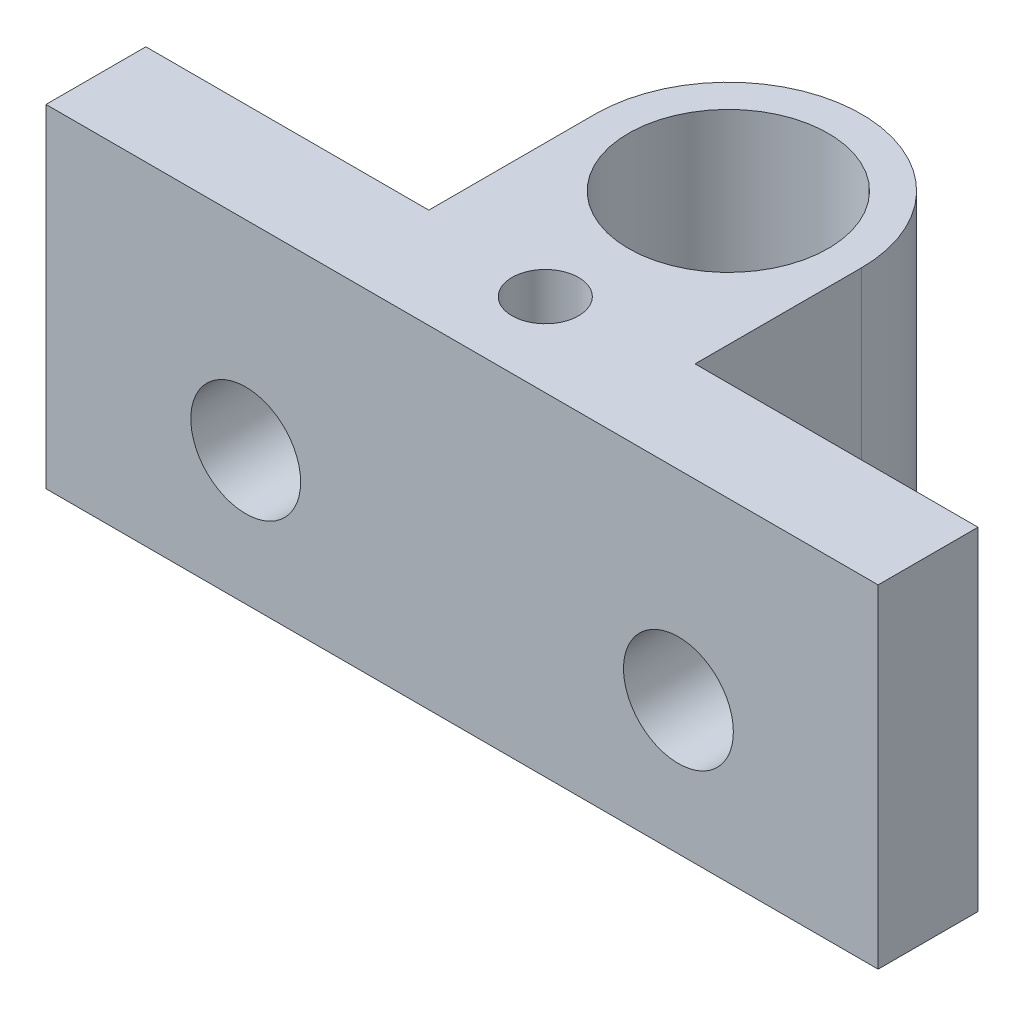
from build123d import *

# Parameters (mm, degrees)
SKETCH_2_R              = 3
EXTRUDE_1_DEPTH         = 10
HOLE_WIZARD_3_3_3_3_1_D = 3.3
CUT_EXTRUDE_1_REACH     = 31.479
SKETCH_5_R              = 1


with BuildPart() as part:
    # Sketch 2 → Extrude 1 (new body)
    with BuildSketch(Plane(origin=(0, 0, 0), x_dir=(1, 0, 0), z_dir=(0, 1, 0))):
        with BuildLine():
            Line((16.5, 3), (16.5, 8))
            ThreePointArc((16.5, 8), (12.5, 12), (8.5, 8))
            Line((8.5, 8), (8.5, 3))
            Line((8.5, 3), (0, 3))
            Line((0, 3), (0, 0))
            Line((0, 0), (25, 0))
            Line((25, 0), (25, 3))
            Line((25, 3), (16.5, 3))
        make_face()
        with Locations(Location((12.5, 8, 0), (0, 0, 270))):
            Circle(SKETCH_2_R, mode=Mode.SUBTRACT)
    extrude(amount=EXTRUDE_1_DEPTH)

    # Hole Wizard 3.3 _3.3_ _1 (through all)
    with Locations(Plane.XY):
        with Locations((6.000011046, 4.000007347), (19.000011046, 4.000007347)):
            Hole(HOLE_WIZARD_3_3_3_3_1_D / 2)

    # Sketch 5 → Cut-Extrude 1 (cut, up to next)
    with BuildSketch(Plane(origin=(0, 10, 0), x_dir=(1, 0, 0), z_dir=(0, 1, 0)), mode=Mode.PRIVATE) as cut_extrude_1_sk1:
        with Locations(Location((12.5, 2.5, 0), (0, 0, 270))):
            Circle(SKETCH_5_R)
    cut_extrude_1_tool1 = extrude(cut_extrude_1_sk1.sketch, amount=-CUT_EXTRUDE_1_REACH, mode=Mode.PRIVATE) & part.part
    add(cut_extrude_1_tool1.solids().sort_by_distance((12.5, 10, -2.5))[0], mode=Mode.SUBTRACT)


solid = part.part
